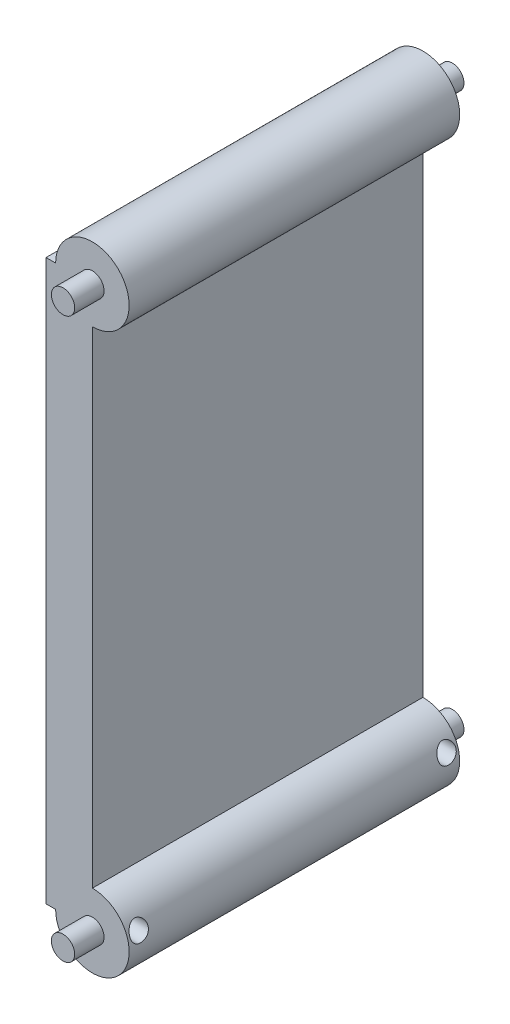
from build123d import *

# Parameters (mm, degrees)
BOSS_EXTRUDE1_DEPTH = 89.9922
SKETCH2_W           = 55
SKETCH2_H           = 89.9922
CUT_EXTRUDE1_DEPTH  = 29.845
SKETCH3_R           = 3.175
BOSS_EXTRUDE2_DEPTH = 52.9971
BOSS_EXTRUDE3_START = -52.9971
SKETCH4_R           = 3.175
BOSS_EXTRUDE3_DEPTH = 52.9971
CUT_EXTRUDE2_REACH  = 193.027
SKETCH5_R           = 2.499995


with BuildPart() as part:
    # Sketch1 → Boss-Extrude1 (new body)
    with BuildSketch(Plane.XY):
        with BuildLine():
            Line((-10.0076, 152.4), (-12.62659937, 152.4))
            Line((-12.62659937, 152.4), (-12.62659937, 29.845))
            Line((-12.62659937, 29.845), (-67.62659937, 29.845))
            Line((-67.62659937, 29.845), (-67.62659937, 19.685))
            Line((-67.62659937, 19.685), (-12.62659937, 19.685))
            Line((-12.62659937, 19.685), (-12.62659937, 10.16))
            Line((-12.62659937, 10.16), (-67.62659937, 10.16))
            Line((-67.62659937, 10.16), (-67.62659937, 0))
            Line((-67.62659937, 0), (-10.0076, 0))
            ThreePointArc((-10.0076, 0), (7.076441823, -7.076441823), (0, 10.0076))
            Line((0, 10.0076), (0, 142.3924))
            ThreePointArc((0, 142.3924), (7.076441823, 159.476441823), (-10.0076, 152.4))
        make_face()
    extrude(amount=BOSS_EXTRUDE1_DEPTH)

    # Sketch2 → Cut-Extrude1 (cut)
    with BuildSketch(Plane(origin=(0, 29.845, 0), x_dir=(1, 0, 0), z_dir=(0, 1, 0))):
        with Locations((-40.12659937, -44.9961)):
            Rectangle(SKETCH2_W, SKETCH2_H)
    extrude(amount=-CUT_EXTRUDE1_DEPTH, mode=Mode.SUBTRACT)

    # Sketch3 → Boss-Extrude2 (add)
    with BuildSketch(Plane(origin=(-12.62659937, 152.4, 44.9961), x_dir=(-1, 0, 0), z_dir=(0, 0, -1))):
        with Locations(Location((-12.62659937, -152.4, 0), (0, 0, 180))):
            Circle(SKETCH3_R)
        with Locations(Location((-12.62659937, 0, 0), (0, 0, 180))):
            Circle(SKETCH3_R)
    extrude(amount=BOSS_EXTRUDE2_DEPTH)

    # Sketch4 → Boss-Extrude3 (add)
    with BuildSketch(Plane(origin=(-12.62659937, 152.4, 44.9961), x_dir=(-1, 0, 0), z_dir=(0, 0, -1)).offset(BOSS_EXTRUDE3_START)):
        with Locations(Location((-12.62659937, -152.4, 0), (0, 0, 180))):
            Circle(SKETCH4_R)
        with Locations(Location((-12.62659937, 0, 0), (0, 0, 180))):
            Circle(SKETCH4_R)
    extrude(amount=BOSS_EXTRUDE3_DEPTH)

    # Sketch5 → Cut-Extrude2 (cut, up to next)
    with BuildSketch(Plane.ZY.offset(12.62659937), mode=Mode.PRIVATE) as cut_extrude2_sk1:
        with Locations(Location((86.868, 3.06, 0), (0, 0, 270))):
            Circle(SKETCH5_R)
    cut_extrude2_tool1 = extrude(cut_extrude2_sk1.sketch, amount=-CUT_EXTRUDE2_REACH, mode=Mode.PRIVATE) & part.part
    # Sketch5 → Cut-Extrude2 (cut, up to next)
    with BuildSketch(Plane.ZY.offset(12.62659937), mode=Mode.PRIVATE) as cut_extrude2_sk2:
        with Locations(Location((3.048, 3.06, 0), (0, 0, 270))):
            Circle(SKETCH5_R)
    cut_extrude2_tool2 = extrude(cut_extrude2_sk2.sketch, amount=-CUT_EXTRUDE2_REACH, mode=Mode.PRIVATE) & part.part
    add(cut_extrude2_tool1.solids().sort_by_distance((-12.626599, 3.06, 86.868))[0], mode=Mode.SUBTRACT)
    add(cut_extrude2_tool2.solids().sort_by_distance((-12.626599, 3.06, 3.048))[0], mode=Mode.SUBTRACT)


solid = part.part
